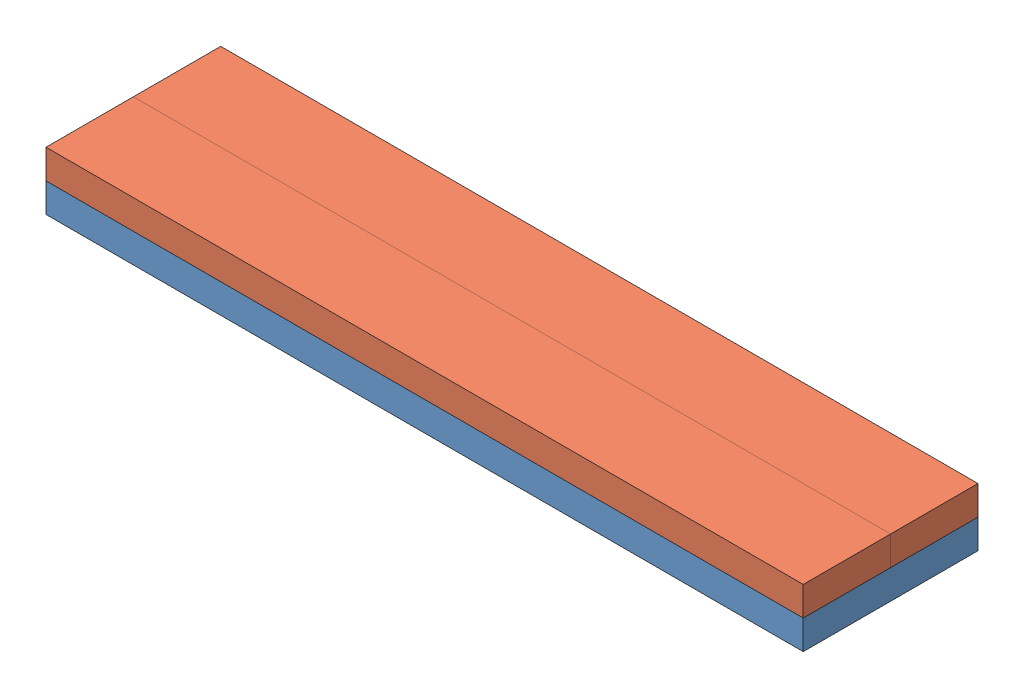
SolidWorks assembly Bottom Layer Assembly.SLDASM, configuration Default (file format 13000). Lengths in mm.
Overall size (82.55 6.35 19.05).
4 component instances, 2 part files, 3 mates.
Components (placement in the parent):
- Bottom Cardboard-1: Bottom Cardboard.SLDPRT [Default] at (-7.9927 45.8733 81.9435) size (82.55 3.17 19.05)
- Popsicle Stick Assembly-1: Popsicle Stick Assembly.SLDASM [Default] at (-8.2221 -4.1441 -0.2138) size (82.55 3.17 19.05)
  - Cut Popsicle Stick-1: Cut Popsicle Stick.SLDPRT [Default] at (0.2294 53.1924 72.6323) size (82.55 3.17 9.53)
  - Cut Popsicle Stick-2: Cut Popsicle Stick.SLDPRT [Default] at (0.2294 53.1924 82.1573) size (82.55 3.17 9.53)
Mates (geometry in assembly coordinates):
- Coincident1: coincident anti-aligned: plane of Bottom Cardboard-1 through (-7.9927 49.0483 81.9435) normal (0 1 0); plane of Popsicle Stick Assembly-1/Cut Popsicle Stick-1 through (-7.9927 49.0483 72.4185) normal (0 -1 0)
- Coincident2: coincident aligned: plane of Bottom Cardboard-1 through (-7.9927 49.0483 81.9435) normal (0 0 1); plane of Popsicle Stick Assembly-1/Cut Popsicle Stick-2 through (-7.9927 52.2233 81.9435) normal (0 0 1)
- Coincident3: coincident aligned: plane of Bottom Cardboard-1 through (-7.9927 49.0483 81.9435) normal (-1 0 0); plane of Popsicle Stick Assembly-1/Cut Popsicle Stick-1 through (-7.9927 52.2233 72.4185) normal (-1 0 0)
